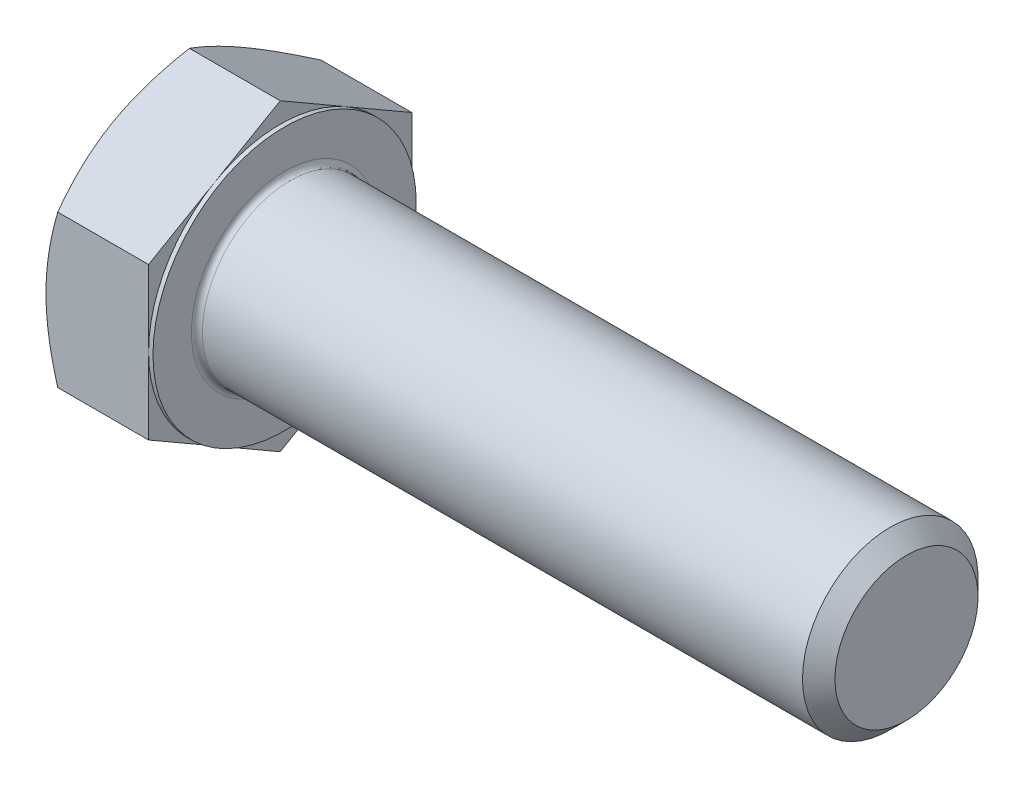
from build123d import *

# Parameters (mm, degrees)
BASEHEAD_DEPTH   = 15.478125
BEARINGFACESKE_W = 0.635
BEARINGFACESKE_H = 2.947045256
FILLET_2_R       = 0.8


with BuildPart() as part:
    # BaseHeadSke → BaseHead (new body)
    with BuildSketch(Plane(origin=(0, 0, 0), x_dir=(0, 0, -1), z_dir=(1, 0, 0))):
        Polygon((19.05, 10.998522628), (0, 21.997045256), (-19.05, 10.998522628), (-19.05, -10.998522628), (0, -21.997045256), (19.05, -10.998522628), align=None)
    extrude(amount=BASEHEAD_DEPTH)

    # BodySke → BaseBody (revolve)
    with BuildSketch(Plane.XY, mode=Mode.PRIVATE) as basebody_sk:
        Polygon((0, 0), (105.478125, 0), (105.478125, 10.352), (103.130125, 12.7), (0, 12.7), align=None)
    revolve(basebody_sk.sketch.rotate(Axis((0, 0, 0), (1, 0, 0)), 90), axis=Axis((0, 0, 0), (1, 0, 0)))

    # HeadChamferSke → HeadChamfer (revolve, cut)
    with BuildSketch(Plane.XY):
        Polygon((1.701477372, 21.997045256), (0, 21.997045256), (0, 19.05), align=None)
    revolve(axis=Axis((0, 0, 0), (1, 0, 0)), mode=Mode.SUBTRACT)

    # BearingFaceSke → BearingFace (revolve, cut)
    with BuildSketch(Plane.XY, mode=Mode.PRIVATE) as bearingface_sk:
        with Locations((15.160625, 20.523522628)):
            Rectangle(BEARINGFACESKE_W, BEARINGFACESKE_H)
    revolve(bearingface_sk.sketch.rotate(Axis((0, 0, 0), (1, 0, 0)), 270), axis=Axis((0, 0, 0), (1, 0, 0)), mode=Mode.SUBTRACT)

    # Fillet 2
    fillet_2_edges = [part.edges().sort_by_distance(p)[0] for p in [
        (15.478125, 0, -12.7),
    ]]
    fillet(fillet_2_edges, radius=FILLET_2_R)


solid = part.part
